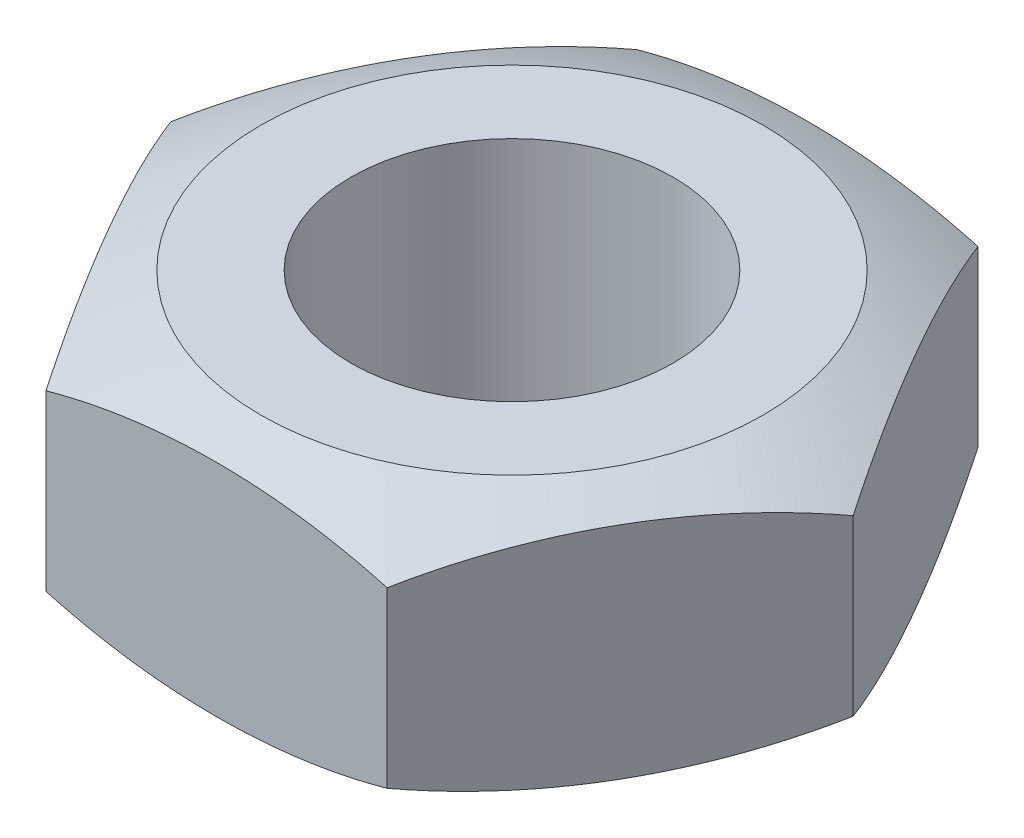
ISO-10303-21;
HEADER;
FILE_DESCRIPTION(('STEP AP214'),'2;1');
FILE_NAME('part.step','',(''),(''),'','','');
FILE_SCHEMA(('AUTOMOTIVE_DESIGN { 1 0 10303 214 1 1 1 1 }'));
ENDSEC;
DATA;
#1=APPLICATION_CONTEXT('core data for automotive mechanical design processes');
#2=APPLICATION_PROTOCOL_DEFINITION('international standard','automotive_design',2000,#1);
#3=PRODUCT_CONTEXT('',#1,'mechanical');
#4=PRODUCT('Part','Part','',(#3));
#5=PRODUCT_RELATED_PRODUCT_CATEGORY('part','',(#4));
#6=PRODUCT_DEFINITION_FORMATION('','',#4);
#7=PRODUCT_DEFINITION_CONTEXT('part definition',#1,'design');
#8=PRODUCT_DEFINITION('design','',#6,#7);
#9=PRODUCT_DEFINITION_SHAPE('','',#8);
#10=(LENGTH_UNIT() NAMED_UNIT(*) SI_UNIT(.MILLI.,.METRE.));
#11=(NAMED_UNIT(*) PLANE_ANGLE_UNIT() SI_UNIT($,.RADIAN.));
#12=(NAMED_UNIT(*) SI_UNIT($,.STERADIAN.) SOLID_ANGLE_UNIT());
#13=UNCERTAINTY_MEASURE_WITH_UNIT(LENGTH_MEASURE(1.E-05),#10,'distance_accuracy_value','');
#14=(GEOMETRIC_REPRESENTATION_CONTEXT(3) GLOBAL_UNCERTAINTY_ASSIGNED_CONTEXT((#13)) GLOBAL_UNIT_ASSIGNED_CONTEXT((#10,
#11,#12)) REPRESENTATION_CONTEXT('',''));
#15=CARTESIAN_POINT('',(0.,0.,0.));
#16=DIRECTION('',(0.,0.,1.));
#17=DIRECTION('',(1.,0.,0.));
#18=AXIS2_PLACEMENT_3D('',#15,#16,#17);
#19=CARTESIAN_POINT('',(0.,2.4,5.5));
#20=DIRECTION('',(0.,-1.,0.));
#21=DIRECTION('',(0.,0.,-1.));
#22=AXIS2_PLACEMENT_3D('',#19,#20,#21);
#23=PLANE('',#22);
#24=CARTESIAN_POINT('',(0.,2.4,0.));
#25=DIRECTION('',(0.,-1.,0.));
#26=DIRECTION('',(0.,0.,-1.));
#27=AXIS2_PLACEMENT_3D('',#24,#25,#26);
#28=CIRCLE('',#27,2.33771324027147);
#29=CARTESIAN_POINT('',(0.,2.4,-2.33771324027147));
#30=VERTEX_POINT('',#29);
#31=EDGE_CURVE('E49',#30,#30,#28,.F.);
#32=ORIENTED_EDGE('',*,*,#31,.T.);
#33=EDGE_LOOP('',(#32));
#34=FACE_BOUND('',#33,.T.);
#35=CARTESIAN_POINT('',(0.,2.4,0.));
#36=DIRECTION('',(0.,1.,0.));
#37=DIRECTION('',(0.,0.,1.));
#38=AXIS2_PLACEMENT_3D('',#35,#36,#37);
#39=CIRCLE('',#38,1.5);
#40=CARTESIAN_POINT('',(0.,2.4,1.5));
#41=VERTEX_POINT('',#40);
#42=EDGE_CURVE('E127',#41,#41,#39,.T.);
#43=ORIENTED_EDGE('',*,*,#42,.F.);
#44=EDGE_LOOP('',(#43));
#45=FACE_BOUND('',#44,.T.);
#46=ADVANCED_FACE('F45',(#34,#45),#23,.F.);
#47=CARTESIAN_POINT('',(0.,0.,5.5));
#48=DIRECTION('',(0.,-1.,0.));
#49=DIRECTION('',(0.,0.,-1.));
#50=AXIS2_PLACEMENT_3D('',#47,#48,#49);
#51=PLANE('',#50);
#52=CARTESIAN_POINT('',(0.,0.,0.));
#53=DIRECTION('',(0.,-1.,0.));
#54=DIRECTION('',(0.,0.,-1.));
#55=AXIS2_PLACEMENT_3D('',#52,#53,#54);
#56=CIRCLE('',#55,2.33771324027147);
#57=CARTESIAN_POINT('',(0.,0.,-2.33771324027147));
#58=VERTEX_POINT('',#57);
#59=EDGE_CURVE('E155',#58,#58,#56,.F.);
#60=ORIENTED_EDGE('',*,*,#59,.F.);
#61=EDGE_LOOP('',(#60));
#62=FACE_BOUND('',#61,.T.);
#63=CARTESIAN_POINT('',(0.,0.,0.));
#64=DIRECTION('',(0.,1.,0.));
#65=DIRECTION('',(0.,0.,1.));
#66=AXIS2_PLACEMENT_3D('',#63,#64,#65);
#67=CIRCLE('',#66,1.5);
#68=CARTESIAN_POINT('',(0.,0.,1.5));
#69=VERTEX_POINT('',#68);
#70=EDGE_CURVE('E133',#69,#69,#67,.T.);
#71=ORIENTED_EDGE('',*,*,#70,.T.);
#72=EDGE_LOOP('',(#71));
#73=FACE_BOUND('',#72,.T.);
#74=ADVANCED_FACE('F206',(#62,#73),#51,.T.);
#75=CARTESIAN_POINT('',(0.,0.,0.));
#76=DIRECTION('',(0.,1.,0.));
#77=DIRECTION('',(0.,0.,1.));
#78=AXIS2_PLACEMENT_3D('',#75,#76,#77);
#79=CYLINDRICAL_SURFACE('',#78,1.5);
#80=ORIENTED_EDGE('',*,*,#70,.F.);
#81=EDGE_LOOP('',(#80));
#82=FACE_BOUND('',#81,.T.);
#83=ORIENTED_EDGE('',*,*,#42,.T.);
#84=EDGE_LOOP('',(#83));
#85=FACE_BOUND('',#84,.T.);
#86=ADVANCED_FACE('F201',(#82,#85),#79,.F.);
#87=CARTESIAN_POINT('',(0.,6.09817245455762,0.));
#88=DIRECTION('',(0.,-1.,0.));
#89=DIRECTION('',(1.,0.,0.));
#90=AXIS2_PLACEMENT_3D('',#87,#88,#89);
#91=SPHERICAL_SURFACE('',#90,6.53089660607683);
#92=ORIENTED_EDGE('',*,*,#59,.T.);
#93=EDGE_LOOP('',(#92));
#94=FACE_BOUND('',#93,.T.);
#95=CARTESIAN_POINT('',(0.,6.09817245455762,2.75));
#96=DIRECTION('',(0.,0.,-1.));
#97=DIRECTION('',(-1.,0.,0.));
#98=AXIS2_PLACEMENT_3D('',#95,#96,#97);
#99=CIRCLE('',#98,5.92369061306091);
#100=CARTESIAN_POINT('',(-1.58771324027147,0.391222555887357,2.75));
#101=VERTEX_POINT('',#100);
#102=CARTESIAN_POINT('',(1.58771324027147,0.391222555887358,2.75));
#103=VERTEX_POINT('',#102);
#104=EDGE_CURVE('E158',#101,#103,#99,.F.);
#105=ORIENTED_EDGE('',*,*,#104,.F.);
#106=CARTESIAN_POINT('',(-2.3815698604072,6.09817245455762,1.375));
#107=DIRECTION('',(0.866025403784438,0.,-0.5));
#108=DIRECTION('',(-0.5,0.,-0.866025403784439));
#109=AXIS2_PLACEMENT_3D('',#106,#107,#108);
#110=CIRCLE('',#109,5.92369061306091);
#111=CARTESIAN_POINT('',(-3.17542648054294,0.391222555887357,0.));
#112=VERTEX_POINT('',#111);
#113=EDGE_CURVE('E163',#112,#101,#110,.F.);
#114=ORIENTED_EDGE('',*,*,#113,.F.);
#115=CARTESIAN_POINT('',(-2.3815698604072,6.09817245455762,-1.375));
#116=DIRECTION('',(0.866025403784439,0.,0.5));
#117=DIRECTION('',(0.5,0.,-0.866025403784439));
#118=AXIS2_PLACEMENT_3D('',#115,#116,#117);
#119=CIRCLE('',#118,5.92369061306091);
#120=CARTESIAN_POINT('',(-1.58771324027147,0.391222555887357,-2.75));
#121=VERTEX_POINT('',#120);
#122=EDGE_CURVE('E169',#121,#112,#119,.F.);
#123=ORIENTED_EDGE('',*,*,#122,.F.);
#124=CARTESIAN_POINT('',(0.,6.09817245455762,-2.75));
#125=DIRECTION('',(0.,0.,1.));
#126=DIRECTION('',(1.,0.,0.));
#127=AXIS2_PLACEMENT_3D('',#124,#125,#126);
#128=CIRCLE('',#127,5.92369061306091);
#129=CARTESIAN_POINT('',(1.58771324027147,0.391222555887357,-2.75));
#130=VERTEX_POINT('',#129);
#131=EDGE_CURVE('E102',#130,#121,#128,.F.);
#132=ORIENTED_EDGE('',*,*,#131,.F.);
#133=CARTESIAN_POINT('',(2.3815698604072,6.09817245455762,-1.375));
#134=DIRECTION('',(-0.866025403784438,0.,0.5));
#135=DIRECTION('',(0.5,0.,0.866025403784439));
#136=AXIS2_PLACEMENT_3D('',#133,#134,#135);
#137=CIRCLE('',#136,5.92369061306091);
#138=CARTESIAN_POINT('',(3.17542648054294,0.391222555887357,0.));
#139=VERTEX_POINT('',#138);
#140=EDGE_CURVE('E99',#139,#130,#137,.F.);
#141=ORIENTED_EDGE('',*,*,#140,.F.);
#142=CARTESIAN_POINT('',(2.38156986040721,6.09817245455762,1.375));
#143=DIRECTION('',(-0.866025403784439,0.,-0.5));
#144=DIRECTION('',(-0.5,0.,0.866025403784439));
#145=AXIS2_PLACEMENT_3D('',#142,#143,#144);
#146=CIRCLE('',#145,5.92369061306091);
#147=EDGE_CURVE('E71',#103,#139,#146,.F.);
#148=ORIENTED_EDGE('',*,*,#147,.F.);
#149=EDGE_LOOP('',(#105,#114,#123,#132,#141,#148));
#150=FACE_BOUND('',#149,.T.);
#151=ADVANCED_FACE('F100',(#94,#150),#91,.T.);
#152=CARTESIAN_POINT('',(0.,-3.69817245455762,0.));
#153=DIRECTION('',(0.,-1.,0.));
#154=DIRECTION('',(1.,0.,0.));
#155=AXIS2_PLACEMENT_3D('',#152,#153,#154);
#156=SPHERICAL_SURFACE('',#155,6.53089660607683);
#157=ORIENTED_EDGE('',*,*,#31,.F.);
#158=EDGE_LOOP('',(#157));
#159=FACE_BOUND('',#158,.T.);
#160=CARTESIAN_POINT('',(2.3815698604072,-3.69817245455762,-1.375));
#161=DIRECTION('',(-0.866025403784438,0.,0.5));
#162=DIRECTION('',(0.5,0.,0.866025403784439));
#163=AXIS2_PLACEMENT_3D('',#160,#161,#162);
#164=CIRCLE('',#163,5.92369061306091);
#165=CARTESIAN_POINT('',(1.58771324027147,2.00877744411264,-2.75));
#166=VERTEX_POINT('',#165);
#167=CARTESIAN_POINT('',(3.17542648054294,2.00877744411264,0.));
#168=VERTEX_POINT('',#167);
#169=EDGE_CURVE('E118',#166,#168,#164,.F.);
#170=ORIENTED_EDGE('',*,*,#169,.F.);
#171=CARTESIAN_POINT('',(0.,-3.69817245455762,-2.75));
#172=DIRECTION('',(0.,0.,1.));
#173=DIRECTION('',(1.,0.,0.));
#174=AXIS2_PLACEMENT_3D('',#171,#172,#173);
#175=CIRCLE('',#174,5.92369061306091);
#176=CARTESIAN_POINT('',(-1.58771324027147,2.00877744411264,-2.75));
#177=VERTEX_POINT('',#176);
#178=EDGE_CURVE('E122',#177,#166,#175,.F.);
#179=ORIENTED_EDGE('',*,*,#178,.F.);
#180=CARTESIAN_POINT('',(-2.3815698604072,-3.69817245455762,-1.375));
#181=DIRECTION('',(0.866025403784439,0.,0.5));
#182=DIRECTION('',(0.5,0.,-0.866025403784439));
#183=AXIS2_PLACEMENT_3D('',#180,#181,#182);
#184=CIRCLE('',#183,5.92369061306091);
#185=CARTESIAN_POINT('',(-3.17542648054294,2.00877744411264,0.));
#186=VERTEX_POINT('',#185);
#187=EDGE_CURVE('E129',#186,#177,#184,.F.);
#188=ORIENTED_EDGE('',*,*,#187,.F.);
#189=CARTESIAN_POINT('',(-2.3815698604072,-3.69817245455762,1.375));
#190=DIRECTION('',(0.866025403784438,0.,-0.5));
#191=DIRECTION('',(-0.5,0.,-0.866025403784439));
#192=AXIS2_PLACEMENT_3D('',#189,#190,#191);
#193=CIRCLE('',#192,5.92369061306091);
#194=CARTESIAN_POINT('',(-1.58771324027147,2.00877744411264,2.75));
#195=VERTEX_POINT('',#194);
#196=EDGE_CURVE('E63',#195,#186,#193,.F.);
#197=ORIENTED_EDGE('',*,*,#196,.F.);
#198=CARTESIAN_POINT('',(0.,-3.69817245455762,2.75));
#199=DIRECTION('',(0.,0.,-1.));
#200=DIRECTION('',(-1.,0.,0.));
#201=AXIS2_PLACEMENT_3D('',#198,#199,#200);
#202=CIRCLE('',#201,5.92369061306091);
#203=CARTESIAN_POINT('',(1.58771324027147,2.00877744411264,2.75));
#204=VERTEX_POINT('',#203);
#205=EDGE_CURVE('E177',#204,#195,#202,.F.);
#206=ORIENTED_EDGE('',*,*,#205,.F.);
#207=CARTESIAN_POINT('',(2.38156986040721,-3.69817245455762,1.375));
#208=DIRECTION('',(-0.866025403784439,0.,-0.5));
#209=DIRECTION('',(-0.5,0.,0.866025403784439));
#210=AXIS2_PLACEMENT_3D('',#207,#208,#209);
#211=CIRCLE('',#210,5.92369061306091);
#212=EDGE_CURVE('E121',#168,#204,#211,.F.);
#213=ORIENTED_EDGE('',*,*,#212,.F.);
#214=EDGE_LOOP('',(#170,#179,#188,#197,#206,#213));
#215=FACE_BOUND('',#214,.T.);
#216=ADVANCED_FACE('F190',(#159,#215),#156,.T.);
#217=CARTESIAN_POINT('',(-1.58771324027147,2.4,2.75));
#218=DIRECTION('',(0.,0.,-1.));
#219=DIRECTION('',(-1.,0.,0.));
#220=AXIS2_PLACEMENT_3D('',#217,#218,#219);
#221=PLANE('',#220);
#222=DIRECTION('',(0.,-1.,0.));
#223=VECTOR('',#222,1.);
#224=CARTESIAN_POINT('',(1.58771324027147,2.4,2.75));
#225=LINE('',#224,#223);
#226=EDGE_CURVE('E113',#204,#103,#225,.T.);
#227=ORIENTED_EDGE('',*,*,#226,.F.);
#228=ORIENTED_EDGE('',*,*,#205,.T.);
#229=DIRECTION('',(0.,-1.,0.));
#230=VECTOR('',#229,1.);
#231=CARTESIAN_POINT('',(-1.58771324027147,2.4,2.75));
#232=LINE('',#231,#230);
#233=EDGE_CURVE('E142',#195,#101,#232,.T.);
#234=ORIENTED_EDGE('',*,*,#233,.T.);
#235=ORIENTED_EDGE('',*,*,#104,.T.);
#236=EDGE_LOOP('',(#227,#228,#234,#235));
#237=FACE_BOUND('',#236,.T.);
#238=ADVANCED_FACE('F192',(#237),#221,.F.);
#239=CARTESIAN_POINT('',(-3.17542648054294,2.4,0.));
#240=DIRECTION('',(0.866025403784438,0.,-0.5));
#241=DIRECTION('',(-0.5,0.,-0.866025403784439));
#242=AXIS2_PLACEMENT_3D('',#239,#240,#241);
#243=PLANE('',#242);
#244=ORIENTED_EDGE('',*,*,#233,.F.);
#245=ORIENTED_EDGE('',*,*,#196,.T.);
#246=DIRECTION('',(0.,-1.,0.));
#247=VECTOR('',#246,1.);
#248=CARTESIAN_POINT('',(-3.17542648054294,2.4,0.));
#249=LINE('',#248,#247);
#250=EDGE_CURVE('E146',#186,#112,#249,.T.);
#251=ORIENTED_EDGE('',*,*,#250,.T.);
#252=ORIENTED_EDGE('',*,*,#113,.T.);
#253=EDGE_LOOP('',(#244,#245,#251,#252));
#254=FACE_BOUND('',#253,.T.);
#255=ADVANCED_FACE('F199',(#254),#243,.F.);
#256=CARTESIAN_POINT('',(-1.58771324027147,2.4,-2.75));
#257=DIRECTION('',(0.866025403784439,0.,0.5));
#258=DIRECTION('',(0.5,0.,-0.866025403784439));
#259=AXIS2_PLACEMENT_3D('',#256,#257,#258);
#260=PLANE('',#259);
#261=ORIENTED_EDGE('',*,*,#250,.F.);
#262=ORIENTED_EDGE('',*,*,#187,.T.);
#263=DIRECTION('',(0.,-1.,0.));
#264=VECTOR('',#263,1.);
#265=CARTESIAN_POINT('',(-1.58771324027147,2.4,-2.75));
#266=LINE('',#265,#264);
#267=EDGE_CURVE('E150',#177,#121,#266,.T.);
#268=ORIENTED_EDGE('',*,*,#267,.T.);
#269=ORIENTED_EDGE('',*,*,#122,.T.);
#270=EDGE_LOOP('',(#261,#262,#268,#269));
#271=FACE_BOUND('',#270,.T.);
#272=ADVANCED_FACE('F187',(#271),#260,.F.);
#273=CARTESIAN_POINT('',(1.58771324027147,2.4,-2.75));
#274=DIRECTION('',(0.,0.,1.));
#275=DIRECTION('',(1.,0.,0.));
#276=AXIS2_PLACEMENT_3D('',#273,#274,#275);
#277=PLANE('',#276);
#278=ORIENTED_EDGE('',*,*,#267,.F.);
#279=ORIENTED_EDGE('',*,*,#178,.T.);
#280=DIRECTION('',(0.,-1.,0.));
#281=VECTOR('',#280,1.);
#282=CARTESIAN_POINT('',(1.58771324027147,2.4,-2.75));
#283=LINE('',#282,#281);
#284=EDGE_CURVE('E55',#166,#130,#283,.T.);
#285=ORIENTED_EDGE('',*,*,#284,.T.);
#286=ORIENTED_EDGE('',*,*,#131,.T.);
#287=EDGE_LOOP('',(#278,#279,#285,#286));
#288=FACE_BOUND('',#287,.T.);
#289=ADVANCED_FACE('F189',(#288),#277,.F.);
#290=CARTESIAN_POINT('',(3.17542648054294,2.4,0.));
#291=DIRECTION('',(-0.866025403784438,0.,0.5));
#292=DIRECTION('',(0.5,0.,0.866025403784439));
#293=AXIS2_PLACEMENT_3D('',#290,#291,#292);
#294=PLANE('',#293);
#295=ORIENTED_EDGE('',*,*,#284,.F.);
#296=ORIENTED_EDGE('',*,*,#169,.T.);
#297=DIRECTION('',(0.,-1.,0.));
#298=VECTOR('',#297,1.);
#299=CARTESIAN_POINT('',(3.17542648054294,2.4,0.));
#300=LINE('',#299,#298);
#301=EDGE_CURVE('E11',#168,#139,#300,.T.);
#302=ORIENTED_EDGE('',*,*,#301,.T.);
#303=ORIENTED_EDGE('',*,*,#140,.T.);
#304=EDGE_LOOP('',(#295,#296,#302,#303));
#305=FACE_BOUND('',#304,.T.);
#306=ADVANCED_FACE('F117',(#305),#294,.F.);
#307=CARTESIAN_POINT('',(1.58771324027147,2.4,2.75));
#308=DIRECTION('',(-0.866025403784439,0.,-0.5));
#309=DIRECTION('',(-0.5,0.,0.866025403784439));
#310=AXIS2_PLACEMENT_3D('',#307,#308,#309);
#311=PLANE('',#310);
#312=ORIENTED_EDGE('',*,*,#301,.F.);
#313=ORIENTED_EDGE('',*,*,#212,.T.);
#314=ORIENTED_EDGE('',*,*,#226,.T.);
#315=ORIENTED_EDGE('',*,*,#147,.T.);
#316=EDGE_LOOP('',(#312,#313,#314,#315));
#317=FACE_BOUND('',#316,.T.);
#318=ADVANCED_FACE('F47',(#317),#311,.F.);
#319=CLOSED_SHELL('',(#46,#74,#86,#151,#216,#238,#255,#272,#289,#306,#318));
#320=MANIFOLD_SOLID_BREP('B2',#319);
#321=ADVANCED_BREP_SHAPE_REPRESENTATION('',(#18,#320),#14);
#322=SHAPE_DEFINITION_REPRESENTATION(#9,#321);
ENDSEC;
END-ISO-10303-21;
